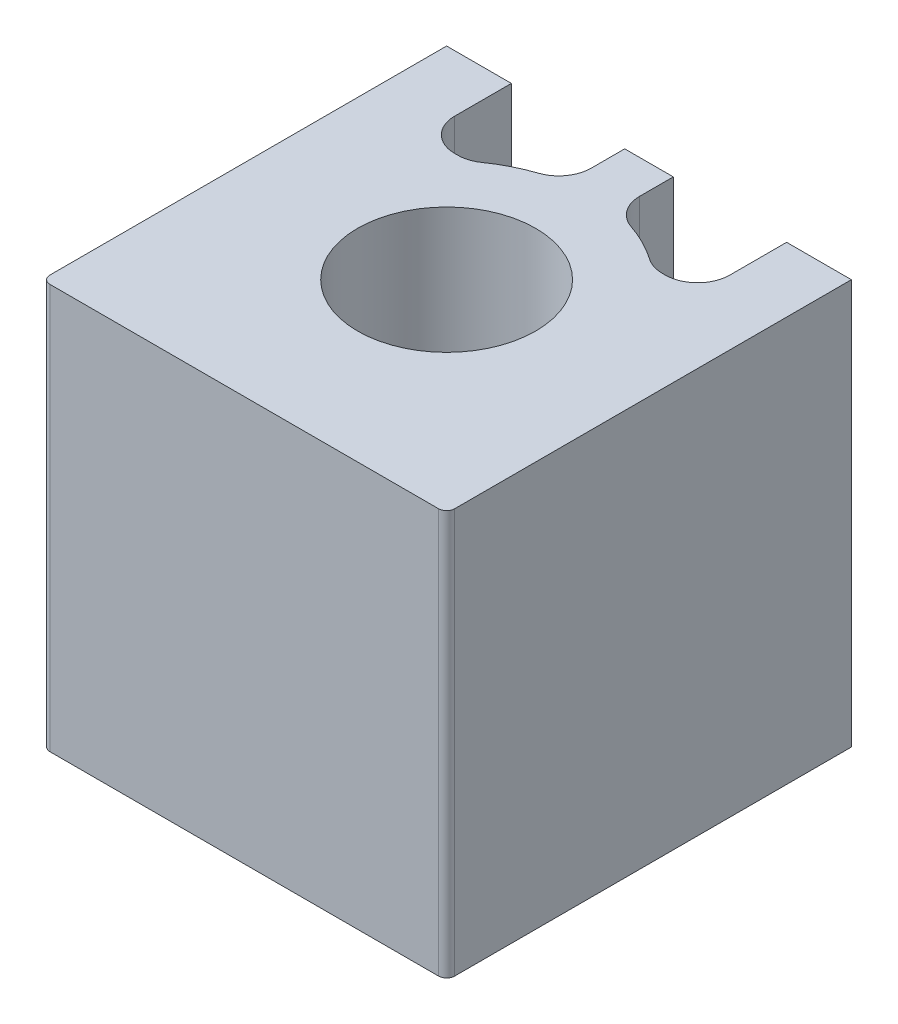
ISO-10303-21;
HEADER;
FILE_DESCRIPTION(('STEP AP214'),'2;1');
FILE_NAME('part.step','',(''),(''),'','','');
FILE_SCHEMA(('AUTOMOTIVE_DESIGN { 1 0 10303 214 1 1 1 1 }'));
ENDSEC;
DATA;
#1=APPLICATION_CONTEXT('core data for automotive mechanical design processes');
#2=APPLICATION_PROTOCOL_DEFINITION('international standard','automotive_design',2000,#1);
#3=PRODUCT_CONTEXT('',#1,'mechanical');
#4=PRODUCT('Part','Part','',(#3));
#5=PRODUCT_RELATED_PRODUCT_CATEGORY('part','',(#4));
#6=PRODUCT_DEFINITION_FORMATION('','',#4);
#7=PRODUCT_DEFINITION_CONTEXT('part definition',#1,'design');
#8=PRODUCT_DEFINITION('design','',#6,#7);
#9=PRODUCT_DEFINITION_SHAPE('','',#8);
#10=(LENGTH_UNIT() NAMED_UNIT(*) SI_UNIT(.MILLI.,.METRE.));
#11=(NAMED_UNIT(*) PLANE_ANGLE_UNIT() SI_UNIT($,.RADIAN.));
#12=(NAMED_UNIT(*) SI_UNIT($,.STERADIAN.) SOLID_ANGLE_UNIT());
#13=UNCERTAINTY_MEASURE_WITH_UNIT(LENGTH_MEASURE(1.E-05),#10,'distance_accuracy_value','');
#14=(GEOMETRIC_REPRESENTATION_CONTEXT(3) GLOBAL_UNCERTAINTY_ASSIGNED_CONTEXT((#13)) GLOBAL_UNIT_ASSIGNED_CONTEXT((#10,
#11,#12)) REPRESENTATION_CONTEXT('',''));
#15=CARTESIAN_POINT('',(0.,0.,0.));
#16=DIRECTION('',(0.,0.,1.));
#17=DIRECTION('',(1.,0.,0.));
#18=AXIS2_PLACEMENT_3D('',#15,#16,#17);
#19=CARTESIAN_POINT('',(0.,25.,-25.));
#20=DIRECTION('',(0.,0.,1.));
#21=DIRECTION('',(1.,0.,0.));
#22=AXIS2_PLACEMENT_3D('',#19,#20,#21);
#23=PLANE('',#22);
#24=DIRECTION('',(-1.,0.,0.));
#25=VECTOR('',#24,1.);
#26=CARTESIAN_POINT('',(0.,0.,-25.));
#27=LINE('',#26,#25);
#28=CARTESIAN_POINT('',(25.,0.,-25.));
#29=VERTEX_POINT('',#28);
#30=CARTESIAN_POINT('',(21.,0.,-25.));
#31=VERTEX_POINT('',#30);
#32=EDGE_CURVE('E210',#29,#31,#27,.T.);
#33=ORIENTED_EDGE('',*,*,#32,.T.);
#34=DIRECTION('',(0.,1.,0.));
#35=VECTOR('',#34,1.);
#36=CARTESIAN_POINT('',(21.,25.,-25.));
#37=LINE('',#36,#35);
#38=CARTESIAN_POINT('',(21.,25.,-25.));
#39=VERTEX_POINT('',#38);
#40=EDGE_CURVE('E203',#31,#39,#37,.T.);
#41=ORIENTED_EDGE('',*,*,#40,.T.);
#42=DIRECTION('',(-1.,0.,0.));
#43=VECTOR('',#42,1.);
#44=CARTESIAN_POINT('',(0.,25.,-25.));
#45=LINE('',#44,#43);
#46=CARTESIAN_POINT('',(25.,25.,-25.));
#47=VERTEX_POINT('',#46);
#48=EDGE_CURVE('E334',#47,#39,#45,.T.);
#49=ORIENTED_EDGE('',*,*,#48,.F.);
#50=DIRECTION('',(0.,-1.,0.));
#51=VECTOR('',#50,1.);
#52=CARTESIAN_POINT('',(25.,25.,-25.));
#53=LINE('',#52,#51);
#54=EDGE_CURVE('E243',#47,#29,#53,.T.);
#55=ORIENTED_EDGE('',*,*,#54,.T.);
#56=EDGE_LOOP('',(#33,#41,#49,#55));
#57=FACE_BOUND('',#56,.T.);
#58=ADVANCED_FACE('F34',(#57),#23,.F.);
#59=CARTESIAN_POINT('',(4.,25.,-25.));
#60=VERTEX_POINT('',#59);
#61=CARTESIAN_POINT('',(0.,25.,-25.));
#62=VERTEX_POINT('',#61);
#63=EDGE_CURVE('E333',#60,#62,#45,.T.);
#64=ORIENTED_EDGE('',*,*,#63,.F.);
#65=DIRECTION('',(0.,-1.,0.));
#66=VECTOR('',#65,1.);
#67=CARTESIAN_POINT('',(4.,25.,-25.));
#68=LINE('',#67,#66);
#69=CARTESIAN_POINT('',(4.,0.,-25.));
#70=VERTEX_POINT('',#69);
#71=EDGE_CURVE('E312',#60,#70,#68,.T.);
#72=ORIENTED_EDGE('',*,*,#71,.T.);
#73=CARTESIAN_POINT('',(0.,0.,-25.));
#74=VERTEX_POINT('',#73);
#75=EDGE_CURVE('E211',#70,#74,#27,.T.);
#76=ORIENTED_EDGE('',*,*,#75,.T.);
#77=DIRECTION('',(0.,-1.,0.));
#78=VECTOR('',#77,1.);
#79=CARTESIAN_POINT('',(0.,25.,-25.));
#80=LINE('',#79,#78);
#81=EDGE_CURVE('E240',#62,#74,#80,.T.);
#82=ORIENTED_EDGE('',*,*,#81,.F.);
#83=EDGE_LOOP('',(#64,#72,#76,#82));
#84=FACE_BOUND('',#83,.T.);
#85=ADVANCED_FACE('F407',(#84),#23,.F.);
#86=CARTESIAN_POINT('',(25.,25.,-25.));
#87=DIRECTION('',(-1.,0.,0.));
#88=DIRECTION('',(0.,0.,1.));
#89=AXIS2_PLACEMENT_3D('',#86,#87,#88);
#90=PLANE('',#89);
#91=DIRECTION('',(0.,0.,-1.));
#92=VECTOR('',#91,1.);
#93=CARTESIAN_POINT('',(25.,0.,-25.));
#94=LINE('',#93,#92);
#95=CARTESIAN_POINT('',(25.,0.,-0.500000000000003));
#96=VERTEX_POINT('',#95);
#97=EDGE_CURVE('E215',#96,#29,#94,.T.);
#98=ORIENTED_EDGE('',*,*,#97,.T.);
#99=ORIENTED_EDGE('',*,*,#54,.F.);
#100=DIRECTION('',(0.,0.,-1.));
#101=VECTOR('',#100,1.);
#102=CARTESIAN_POINT('',(25.,25.,-25.));
#103=LINE('',#102,#101);
#104=CARTESIAN_POINT('',(25.,25.,-0.500000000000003));
#105=VERTEX_POINT('',#104);
#106=EDGE_CURVE('E226',#105,#47,#103,.T.);
#107=ORIENTED_EDGE('',*,*,#106,.F.);
#108=DIRECTION('',(0.,-1.,0.));
#109=VECTOR('',#108,1.);
#110=CARTESIAN_POINT('',(25.,25.,-0.500000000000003));
#111=LINE('',#110,#109);
#112=EDGE_CURVE('E227',#105,#96,#111,.T.);
#113=ORIENTED_EDGE('',*,*,#112,.T.);
#114=EDGE_LOOP('',(#98,#99,#107,#113));
#115=FACE_BOUND('',#114,.T.);
#116=ADVANCED_FACE('F356',(#115),#90,.F.);
#117=CARTESIAN_POINT('',(14.,25.,-25.));
#118=VERTEX_POINT('',#117);
#119=CARTESIAN_POINT('',(11.,25.,-25.));
#120=VERTEX_POINT('',#119);
#121=EDGE_CURVE('E202',#118,#120,#45,.T.);
#122=ORIENTED_EDGE('',*,*,#121,.F.);
#123=DIRECTION('',(0.,-1.,0.));
#124=VECTOR('',#123,1.);
#125=CARTESIAN_POINT('',(14.,25.,-25.));
#126=LINE('',#125,#124);
#127=CARTESIAN_POINT('',(14.,0.,-25.));
#128=VERTEX_POINT('',#127);
#129=EDGE_CURVE('E187',#118,#128,#126,.T.);
#130=ORIENTED_EDGE('',*,*,#129,.T.);
#131=CARTESIAN_POINT('',(11.,0.,-25.));
#132=VERTEX_POINT('',#131);
#133=EDGE_CURVE('E200',#128,#132,#27,.T.);
#134=ORIENTED_EDGE('',*,*,#133,.T.);
#135=DIRECTION('',(0.,1.,0.));
#136=VECTOR('',#135,1.);
#137=CARTESIAN_POINT('',(11.,25.,-25.));
#138=LINE('',#137,#136);
#139=EDGE_CURVE('E325',#132,#120,#138,.T.);
#140=ORIENTED_EDGE('',*,*,#139,.T.);
#141=EDGE_LOOP('',(#122,#130,#134,#140));
#142=FACE_BOUND('',#141,.T.);
#143=ADVANCED_FACE('F198',(#142),#23,.F.);
#144=CARTESIAN_POINT('',(0.,25.,-25.));
#145=DIRECTION('',(1.,0.,0.));
#146=DIRECTION('',(0.,0.,-1.));
#147=AXIS2_PLACEMENT_3D('',#144,#145,#146);
#148=PLANE('',#147);
#149=DIRECTION('',(0.,0.,1.));
#150=VECTOR('',#149,1.);
#151=CARTESIAN_POINT('',(0.,0.,-25.));
#152=LINE('',#151,#150);
#153=CARTESIAN_POINT('',(0.,0.,-0.500000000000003));
#154=VERTEX_POINT('',#153);
#155=EDGE_CURVE('E214',#74,#154,#152,.T.);
#156=ORIENTED_EDGE('',*,*,#155,.T.);
#157=DIRECTION('',(0.,-1.,0.));
#158=VECTOR('',#157,1.);
#159=CARTESIAN_POINT('',(0.,25.,-0.500000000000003));
#160=LINE('',#159,#158);
#161=CARTESIAN_POINT('',(0.,25.,-0.500000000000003));
#162=VERTEX_POINT('',#161);
#163=EDGE_CURVE('E237',#162,#154,#160,.T.);
#164=ORIENTED_EDGE('',*,*,#163,.F.);
#165=DIRECTION('',(0.,0.,1.));
#166=VECTOR('',#165,1.);
#167=CARTESIAN_POINT('',(0.,25.,-25.));
#168=LINE('',#167,#166);
#169=EDGE_CURVE('E337',#62,#162,#168,.T.);
#170=ORIENTED_EDGE('',*,*,#169,.F.);
#171=ORIENTED_EDGE('',*,*,#81,.T.);
#172=EDGE_LOOP('',(#156,#164,#170,#171));
#173=FACE_BOUND('',#172,.T.);
#174=ADVANCED_FACE('F416',(#173),#148,.F.);
#175=CARTESIAN_POINT('',(0.5,25.,-0.5));
#176=DIRECTION('',(0.,-1.,0.));
#177=DIRECTION('',(0.,0.,-1.));
#178=AXIS2_PLACEMENT_3D('',#175,#176,#177);
#179=CYLINDRICAL_SURFACE('',#178,0.5);
#180=CARTESIAN_POINT('',(0.5,0.,-0.5));
#181=DIRECTION('',(0.,1.,0.));
#182=DIRECTION('',(0.,0.,1.));
#183=AXIS2_PLACEMENT_3D('',#180,#181,#182);
#184=CIRCLE('',#183,0.5);
#185=CARTESIAN_POINT('',(0.500000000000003,0.,0.));
#186=VERTEX_POINT('',#185);
#187=EDGE_CURVE('E220',#154,#186,#184,.T.);
#188=ORIENTED_EDGE('',*,*,#187,.T.);
#189=DIRECTION('',(0.,-1.,0.));
#190=VECTOR('',#189,1.);
#191=CARTESIAN_POINT('',(0.500000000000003,25.,0.));
#192=LINE('',#191,#190);
#193=CARTESIAN_POINT('',(0.500000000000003,25.,0.));
#194=VERTEX_POINT('',#193);
#195=EDGE_CURVE('E234',#194,#186,#192,.T.);
#196=ORIENTED_EDGE('',*,*,#195,.F.);
#197=CARTESIAN_POINT('',(0.5,25.,-0.5));
#198=DIRECTION('',(0.,1.,0.));
#199=DIRECTION('',(0.,0.,1.));
#200=AXIS2_PLACEMENT_3D('',#197,#198,#199);
#201=CIRCLE('',#200,0.5);
#202=EDGE_CURVE('E339',#162,#194,#201,.T.);
#203=ORIENTED_EDGE('',*,*,#202,.F.);
#204=ORIENTED_EDGE('',*,*,#163,.T.);
#205=EDGE_LOOP('',(#188,#196,#203,#204));
#206=FACE_BOUND('',#205,.T.);
#207=ADVANCED_FACE('F421',(#206),#179,.T.);
#208=CARTESIAN_POINT('',(0.500000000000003,25.,0.));
#209=DIRECTION('',(0.,0.,-1.));
#210=DIRECTION('',(-1.,0.,0.));
#211=AXIS2_PLACEMENT_3D('',#208,#209,#210);
#212=PLANE('',#211);
#213=DIRECTION('',(1.,0.,0.));
#214=VECTOR('',#213,1.);
#215=CARTESIAN_POINT('',(0.500000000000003,0.,0.));
#216=LINE('',#215,#214);
#217=CARTESIAN_POINT('',(24.5,0.,0.));
#218=VERTEX_POINT('',#217);
#219=EDGE_CURVE('E222',#186,#218,#216,.T.);
#220=ORIENTED_EDGE('',*,*,#219,.T.);
#221=DIRECTION('',(0.,-1.,0.));
#222=VECTOR('',#221,1.);
#223=CARTESIAN_POINT('',(24.5,25.,0.));
#224=LINE('',#223,#222);
#225=CARTESIAN_POINT('',(24.5,25.,0.));
#226=VERTEX_POINT('',#225);
#227=EDGE_CURVE('E230',#226,#218,#224,.T.);
#228=ORIENTED_EDGE('',*,*,#227,.F.);
#229=DIRECTION('',(1.,0.,0.));
#230=VECTOR('',#229,1.);
#231=CARTESIAN_POINT('',(0.500000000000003,25.,0.));
#232=LINE('',#231,#230);
#233=EDGE_CURVE('E341',#194,#226,#232,.T.);
#234=ORIENTED_EDGE('',*,*,#233,.F.);
#235=ORIENTED_EDGE('',*,*,#195,.T.);
#236=EDGE_LOOP('',(#220,#228,#234,#235));
#237=FACE_BOUND('',#236,.T.);
#238=ADVANCED_FACE('F466',(#237),#212,.F.);
#239=CARTESIAN_POINT('',(24.5,25.,-0.5));
#240=DIRECTION('',(0.,-1.,0.));
#241=DIRECTION('',(0.,0.,-1.));
#242=AXIS2_PLACEMENT_3D('',#239,#240,#241);
#243=CYLINDRICAL_SURFACE('',#242,0.5);
#244=CARTESIAN_POINT('',(24.5,0.,-0.5));
#245=DIRECTION('',(0.,1.,0.));
#246=DIRECTION('',(0.,0.,1.));
#247=AXIS2_PLACEMENT_3D('',#244,#245,#246);
#248=CIRCLE('',#247,0.5);
#249=EDGE_CURVE('E224',#218,#96,#248,.T.);
#250=ORIENTED_EDGE('',*,*,#249,.T.);
#251=ORIENTED_EDGE('',*,*,#112,.F.);
#252=CARTESIAN_POINT('',(24.5,25.,-0.5));
#253=DIRECTION('',(0.,1.,0.));
#254=DIRECTION('',(0.,0.,1.));
#255=AXIS2_PLACEMENT_3D('',#252,#253,#254);
#256=CIRCLE('',#255,0.5);
#257=EDGE_CURVE('E231',#226,#105,#256,.T.);
#258=ORIENTED_EDGE('',*,*,#257,.F.);
#259=ORIENTED_EDGE('',*,*,#227,.T.);
#260=EDGE_LOOP('',(#250,#251,#258,#259));
#261=FACE_BOUND('',#260,.T.);
#262=ADVANCED_FACE('F351',(#261),#243,.T.);
#263=CARTESIAN_POINT('',(24.5,25.,-0.5));
#264=DIRECTION('',(0.,1.,0.));
#265=DIRECTION('',(0.,0.,1.));
#266=AXIS2_PLACEMENT_3D('',#263,#264,#265);
#267=PLANE('',#266);
#268=CARTESIAN_POINT('',(12.5,25.,-12.5));
#269=DIRECTION('',(0.,-1.,0.));
#270=DIRECTION('',(0.,0.,-1.));
#271=AXIS2_PLACEMENT_3D('',#268,#269,#270);
#272=CIRCLE('',#271,5.5);
#273=CARTESIAN_POINT('',(12.5,25.,-18.));
#274=VERTEX_POINT('',#273);
#275=EDGE_CURVE('E377',#274,#274,#272,.T.);
#276=ORIENTED_EDGE('',*,*,#275,.T.);
#277=EDGE_LOOP('',(#276));
#278=FACE_BOUND('',#277,.T.);
#279=DIRECTION('',(0.,0.,1.));
#280=VECTOR('',#279,1.);
#281=CARTESIAN_POINT('',(21.,25.,-30.5));
#282=LINE('',#281,#280);
#283=CARTESIAN_POINT('',(21.,25.,-21.5));
#284=VERTEX_POINT('',#283);
#285=EDGE_CURVE('E193',#39,#284,#282,.T.);
#286=ORIENTED_EDGE('',*,*,#285,.T.);
#287=CARTESIAN_POINT('',(19.,25.,-21.5));
#288=DIRECTION('',(0.,1.,0.));
#289=DIRECTION('',(0.,0.,1.));
#290=AXIS2_PLACEMENT_3D('',#287,#288,#289);
#291=CIRCLE('',#290,2.);
#292=CARTESIAN_POINT('',(19.,25.,-19.5));
#293=VERTEX_POINT('',#292);
#294=EDGE_CURVE('E282',#284,#293,#291,.F.);
#295=ORIENTED_EDGE('',*,*,#294,.T.);
#296=DIRECTION('',(-1.,0.,0.));
#297=VECTOR('',#296,1.);
#298=CARTESIAN_POINT('',(21.,25.,-19.5));
#299=LINE('',#298,#297);
#300=CARTESIAN_POINT('',(18.8245553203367,25.,-19.5));
#301=VERTEX_POINT('',#300);
#302=EDGE_CURVE('E364',#293,#301,#299,.T.);
#303=ORIENTED_EDGE('',*,*,#302,.T.);
#304=CARTESIAN_POINT('',(18.8245553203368,25.,-21.5));
#305=DIRECTION('',(0.,1.,0.));
#306=DIRECTION('',(0.,0.,1.));
#307=AXIS2_PLACEMENT_3D('',#304,#305,#306);
#308=CIRCLE('',#307,2.);
#309=CARTESIAN_POINT('',(17.6746361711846,25.,-19.8636363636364));
#310=VERTEX_POINT('',#309);
#311=EDGE_CURVE('E286',#301,#310,#308,.F.);
#312=ORIENTED_EDGE('',*,*,#311,.T.);
#313=CARTESIAN_POINT('',(12.5,25.,-12.5));
#314=DIRECTION('',(0.,1.,0.));
#315=DIRECTION('',(0.,0.,-1.));
#316=AXIS2_PLACEMENT_3D('',#313,#314,#315);
#317=CIRCLE('',#316,9.);
#318=CARTESIAN_POINT('',(15.3636363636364,25.,-21.0322673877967));
#319=VERTEX_POINT('',#318);
#320=EDGE_CURVE('E386',#310,#319,#317,.T.);
#321=ORIENTED_EDGE('',*,*,#320,.T.);
#322=CARTESIAN_POINT('',(16.,25.,-22.9283268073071));
#323=DIRECTION('',(0.,1.,0.));
#324=DIRECTION('',(0.,0.,1.));
#325=AXIS2_PLACEMENT_3D('',#322,#323,#324);
#326=CIRCLE('',#325,2.);
#327=CARTESIAN_POINT('',(14.,25.,-22.9283268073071));
#328=VERTEX_POINT('',#327);
#329=EDGE_CURVE('E290',#319,#328,#326,.F.);
#330=ORIENTED_EDGE('',*,*,#329,.T.);
#331=DIRECTION('',(0.,0.,-1.));
#332=VECTOR('',#331,1.);
#333=CARTESIAN_POINT('',(14.,25.,-21.3741196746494));
#334=LINE('',#333,#332);
#335=EDGE_CURVE('E204',#328,#118,#334,.T.);
#336=ORIENTED_EDGE('',*,*,#335,.T.);
#337=ORIENTED_EDGE('',*,*,#121,.T.);
#338=DIRECTION('',(0.,0.,1.));
#339=VECTOR('',#338,1.);
#340=CARTESIAN_POINT('',(11.,25.,-21.3741196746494));
#341=LINE('',#340,#339);
#342=CARTESIAN_POINT('',(11.,25.,-22.9283268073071));
#343=VERTEX_POINT('',#342);
#344=EDGE_CURVE('E314',#120,#343,#341,.T.);
#345=ORIENTED_EDGE('',*,*,#344,.T.);
#346=CARTESIAN_POINT('',(9.,25.,-22.9283268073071));
#347=DIRECTION('',(0.,1.,0.));
#348=DIRECTION('',(0.,0.,1.));
#349=AXIS2_PLACEMENT_3D('',#346,#347,#348);
#350=CIRCLE('',#349,2.);
#351=CARTESIAN_POINT('',(9.63636363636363,25.,-21.0322673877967));
#352=VERTEX_POINT('',#351);
#353=EDGE_CURVE('E278',#343,#352,#350,.F.);
#354=ORIENTED_EDGE('',*,*,#353,.T.);
#355=CARTESIAN_POINT('',(12.5,25.,-12.5));
#356=DIRECTION('',(0.,1.,0.));
#357=DIRECTION('',(0.,0.,-1.));
#358=AXIS2_PLACEMENT_3D('',#355,#356,#357);
#359=CIRCLE('',#358,9.);
#360=CARTESIAN_POINT('',(7.32536382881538,25.,-19.8636363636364));
#361=VERTEX_POINT('',#360);
#362=EDGE_CURVE('E317',#352,#361,#359,.T.);
#363=ORIENTED_EDGE('',*,*,#362,.T.);
#364=CARTESIAN_POINT('',(6.17544467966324,25.,-21.5));
#365=DIRECTION('',(0.,1.,0.));
#366=DIRECTION('',(0.,0.,1.));
#367=AXIS2_PLACEMENT_3D('',#364,#365,#366);
#368=CIRCLE('',#367,2.);
#369=CARTESIAN_POINT('',(6.17544467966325,25.,-19.5));
#370=VERTEX_POINT('',#369);
#371=EDGE_CURVE('E294',#361,#370,#368,.F.);
#372=ORIENTED_EDGE('',*,*,#371,.T.);
#373=DIRECTION('',(-1.,0.,0.));
#374=VECTOR('',#373,1.);
#375=CARTESIAN_POINT('',(4.,25.,-19.5));
#376=LINE('',#375,#374);
#377=CARTESIAN_POINT('',(6.,25.,-19.5));
#378=VERTEX_POINT('',#377);
#379=EDGE_CURVE('E323',#370,#378,#376,.T.);
#380=ORIENTED_EDGE('',*,*,#379,.T.);
#381=CARTESIAN_POINT('',(6.,25.,-21.5));
#382=DIRECTION('',(0.,1.,0.));
#383=DIRECTION('',(0.,0.,1.));
#384=AXIS2_PLACEMENT_3D('',#381,#382,#383);
#385=CIRCLE('',#384,2.);
#386=CARTESIAN_POINT('',(4.,25.,-21.5));
#387=VERTEX_POINT('',#386);
#388=EDGE_CURVE('E11',#378,#387,#385,.F.);
#389=ORIENTED_EDGE('',*,*,#388,.T.);
#390=DIRECTION('',(0.,0.,-1.));
#391=VECTOR('',#390,1.);
#392=CARTESIAN_POINT('',(4.,25.,-30.5));
#393=LINE('',#392,#391);
#394=EDGE_CURVE('E305',#387,#60,#393,.T.);
#395=ORIENTED_EDGE('',*,*,#394,.T.);
#396=ORIENTED_EDGE('',*,*,#63,.T.);
#397=ORIENTED_EDGE('',*,*,#169,.T.);
#398=ORIENTED_EDGE('',*,*,#202,.T.);
#399=ORIENTED_EDGE('',*,*,#233,.T.);
#400=ORIENTED_EDGE('',*,*,#257,.T.);
#401=ORIENTED_EDGE('',*,*,#106,.T.);
#402=ORIENTED_EDGE('',*,*,#48,.T.);
#403=EDGE_LOOP('',(#286,#295,#303,#312,#321,#330,#336,#337,#345,#354,#363,#372,#380,#389,#395,
#396,#397,#398,#399,#400,#401,#402));
#404=FACE_BOUND('',#403,.T.);
#405=ADVANCED_FACE('F345',(#278,#404),#267,.T.);
#406=CARTESIAN_POINT('',(24.5,0.,-0.5));
#407=DIRECTION('',(0.,1.,0.));
#408=DIRECTION('',(0.,0.,1.));
#409=AXIS2_PLACEMENT_3D('',#406,#407,#408);
#410=PLANE('',#409);
#411=CARTESIAN_POINT('',(12.5,0.,-12.5));
#412=DIRECTION('',(0.,-1.,0.));
#413=DIRECTION('',(0.,0.,-1.));
#414=AXIS2_PLACEMENT_3D('',#411,#412,#413);
#415=CIRCLE('',#414,5.5);
#416=CARTESIAN_POINT('',(12.5,0.,-18.));
#417=VERTEX_POINT('',#416);
#418=EDGE_CURVE('E382',#417,#417,#415,.T.);
#419=ORIENTED_EDGE('',*,*,#418,.F.);
#420=EDGE_LOOP('',(#419));
#421=FACE_BOUND('',#420,.T.);
#422=DIRECTION('',(-1.,0.,0.));
#423=VECTOR('',#422,1.);
#424=CARTESIAN_POINT('',(21.,0.,-19.5));
#425=LINE('',#424,#423);
#426=CARTESIAN_POINT('',(19.,0.,-19.5));
#427=VERTEX_POINT('',#426);
#428=CARTESIAN_POINT('',(18.8245553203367,0.,-19.5));
#429=VERTEX_POINT('',#428);
#430=EDGE_CURVE('E373',#427,#429,#425,.T.);
#431=ORIENTED_EDGE('',*,*,#430,.F.);
#432=CARTESIAN_POINT('',(19.,0.,-21.5));
#433=DIRECTION('',(0.,1.,0.));
#434=DIRECTION('',(0.,0.,1.));
#435=AXIS2_PLACEMENT_3D('',#432,#433,#434);
#436=CIRCLE('',#435,2.);
#437=CARTESIAN_POINT('',(21.,0.,-21.5));
#438=VERTEX_POINT('',#437);
#439=EDGE_CURVE('E280',#427,#438,#436,.T.);
#440=ORIENTED_EDGE('',*,*,#439,.T.);
#441=DIRECTION('',(0.,0.,-1.));
#442=VECTOR('',#441,1.);
#443=CARTESIAN_POINT('',(21.,0.,-0.5));
#444=LINE('',#443,#442);
#445=EDGE_CURVE('E247',#438,#31,#444,.T.);
#446=ORIENTED_EDGE('',*,*,#445,.T.);
#447=ORIENTED_EDGE('',*,*,#32,.F.);
#448=ORIENTED_EDGE('',*,*,#97,.F.);
#449=ORIENTED_EDGE('',*,*,#249,.F.);
#450=ORIENTED_EDGE('',*,*,#219,.F.);
#451=ORIENTED_EDGE('',*,*,#187,.F.);
#452=ORIENTED_EDGE('',*,*,#155,.F.);
#453=ORIENTED_EDGE('',*,*,#75,.F.);
#454=DIRECTION('',(0.,0.,-1.));
#455=VECTOR('',#454,1.);
#456=CARTESIAN_POINT('',(4.,0.,-30.5));
#457=LINE('',#456,#455);
#458=CARTESIAN_POINT('',(4.,0.,-21.5));
#459=VERTEX_POINT('',#458);
#460=EDGE_CURVE('E300',#459,#70,#457,.T.);
#461=ORIENTED_EDGE('',*,*,#460,.F.);
#462=CARTESIAN_POINT('',(6.,0.,-21.5));
#463=DIRECTION('',(0.,1.,0.));
#464=DIRECTION('',(0.,0.,1.));
#465=AXIS2_PLACEMENT_3D('',#462,#463,#464);
#466=CIRCLE('',#465,2.);
#467=CARTESIAN_POINT('',(6.,0.,-19.5));
#468=VERTEX_POINT('',#467);
#469=EDGE_CURVE('E42',#459,#468,#466,.T.);
#470=ORIENTED_EDGE('',*,*,#469,.T.);
#471=DIRECTION('',(-1.,0.,0.));
#472=VECTOR('',#471,1.);
#473=CARTESIAN_POINT('',(4.,0.,-19.5));
#474=LINE('',#473,#472);
#475=CARTESIAN_POINT('',(6.17544467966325,0.,-19.5));
#476=VERTEX_POINT('',#475);
#477=EDGE_CURVE('E298',#476,#468,#474,.T.);
#478=ORIENTED_EDGE('',*,*,#477,.F.);
#479=CARTESIAN_POINT('',(6.17544467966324,0.,-21.5));
#480=DIRECTION('',(0.,1.,0.));
#481=DIRECTION('',(0.,0.,1.));
#482=AXIS2_PLACEMENT_3D('',#479,#480,#481);
#483=CIRCLE('',#482,2.);
#484=CARTESIAN_POINT('',(7.32536382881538,0.,-19.8636363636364));
#485=VERTEX_POINT('',#484);
#486=EDGE_CURVE('E292',#476,#485,#483,.T.);
#487=ORIENTED_EDGE('',*,*,#486,.T.);
#488=CARTESIAN_POINT('',(12.5,0.,-12.5));
#489=DIRECTION('',(0.,1.,0.));
#490=DIRECTION('',(0.,0.,-1.));
#491=AXIS2_PLACEMENT_3D('',#488,#489,#490);
#492=CIRCLE('',#491,9.);
#493=CARTESIAN_POINT('',(9.63636363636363,0.,-21.0322673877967));
#494=VERTEX_POINT('',#493);
#495=EDGE_CURVE('E306',#494,#485,#492,.T.);
#496=ORIENTED_EDGE('',*,*,#495,.F.);
#497=CARTESIAN_POINT('',(9.,0.,-22.9283268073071));
#498=DIRECTION('',(0.,1.,0.));
#499=DIRECTION('',(0.,0.,1.));
#500=AXIS2_PLACEMENT_3D('',#497,#498,#499);
#501=CIRCLE('',#500,2.);
#502=CARTESIAN_POINT('',(11.,0.,-22.9283268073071));
#503=VERTEX_POINT('',#502);
#504=EDGE_CURVE('E276',#494,#503,#501,.T.);
#505=ORIENTED_EDGE('',*,*,#504,.T.);
#506=DIRECTION('',(0.,0.,-1.));
#507=VECTOR('',#506,1.);
#508=CARTESIAN_POINT('',(11.,0.,-0.499999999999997));
#509=LINE('',#508,#507);
#510=EDGE_CURVE('E209',#503,#132,#509,.T.);
#511=ORIENTED_EDGE('',*,*,#510,.T.);
#512=ORIENTED_EDGE('',*,*,#133,.F.);
#513=DIRECTION('',(0.,0.,-1.));
#514=VECTOR('',#513,1.);
#515=CARTESIAN_POINT('',(14.,0.,-21.3741196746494));
#516=LINE('',#515,#514);
#517=CARTESIAN_POINT('',(14.,0.,-22.9283268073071));
#518=VERTEX_POINT('',#517);
#519=EDGE_CURVE('E183',#518,#128,#516,.T.);
#520=ORIENTED_EDGE('',*,*,#519,.F.);
#521=CARTESIAN_POINT('',(16.,0.,-22.9283268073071));
#522=DIRECTION('',(0.,1.,0.));
#523=DIRECTION('',(0.,0.,1.));
#524=AXIS2_PLACEMENT_3D('',#521,#522,#523);
#525=CIRCLE('',#524,2.);
#526=CARTESIAN_POINT('',(15.3636363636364,0.,-21.0322673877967));
#527=VERTEX_POINT('',#526);
#528=EDGE_CURVE('E288',#518,#527,#525,.T.);
#529=ORIENTED_EDGE('',*,*,#528,.T.);
#530=CARTESIAN_POINT('',(12.5,0.,-12.5));
#531=DIRECTION('',(0.,1.,0.));
#532=DIRECTION('',(0.,0.,-1.));
#533=AXIS2_PLACEMENT_3D('',#530,#531,#532);
#534=CIRCLE('',#533,9.);
#535=CARTESIAN_POINT('',(17.6746361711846,0.,-19.8636363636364));
#536=VERTEX_POINT('',#535);
#537=EDGE_CURVE('E194',#536,#527,#534,.T.);
#538=ORIENTED_EDGE('',*,*,#537,.F.);
#539=CARTESIAN_POINT('',(18.8245553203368,0.,-21.5));
#540=DIRECTION('',(0.,1.,0.));
#541=DIRECTION('',(0.,0.,1.));
#542=AXIS2_PLACEMENT_3D('',#539,#540,#541);
#543=CIRCLE('',#542,2.);
#544=EDGE_CURVE('E284',#536,#429,#543,.T.);
#545=ORIENTED_EDGE('',*,*,#544,.T.);
#546=EDGE_LOOP('',(#431,#440,#446,#447,#448,#449,#450,#451,#452,#453,#461,#470,#478,#487,#496,
#505,#511,#512,#520,#529,#538,#545));
#547=FACE_BOUND('',#546,.T.);
#548=ADVANCED_FACE('F207',(#421,#547),#410,.F.);
#549=CARTESIAN_POINT('',(4.,25.,-30.5));
#550=DIRECTION('',(-1.,0.,0.));
#551=DIRECTION('',(0.,0.,1.));
#552=AXIS2_PLACEMENT_3D('',#549,#550,#551);
#553=PLANE('',#552);
#554=ORIENTED_EDGE('',*,*,#394,.F.);
#555=DIRECTION('',(0.,-1.,0.));
#556=VECTOR('',#555,1.);
#557=CARTESIAN_POINT('',(4.,0.,-21.5));
#558=LINE('',#557,#556);
#559=EDGE_CURVE('E274',#387,#459,#558,.T.);
#560=ORIENTED_EDGE('',*,*,#559,.T.);
#561=ORIENTED_EDGE('',*,*,#460,.T.);
#562=ORIENTED_EDGE('',*,*,#71,.F.);
#563=EDGE_LOOP('',(#554,#560,#561,#562));
#564=FACE_BOUND('',#563,.T.);
#565=ADVANCED_FACE('F309',(#564),#553,.F.);
#566=CARTESIAN_POINT('',(11.,25.,-21.3741196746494));
#567=DIRECTION('',(1.,0.,0.));
#568=DIRECTION('',(0.,0.,-1.));
#569=AXIS2_PLACEMENT_3D('',#566,#567,#568);
#570=PLANE('',#569);
#571=ORIENTED_EDGE('',*,*,#510,.F.);
#572=DIRECTION('',(0.,1.,0.));
#573=VECTOR('',#572,1.);
#574=CARTESIAN_POINT('',(11.,25.,-22.9283268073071));
#575=LINE('',#574,#573);
#576=EDGE_CURVE('E254',#503,#343,#575,.T.);
#577=ORIENTED_EDGE('',*,*,#576,.T.);
#578=ORIENTED_EDGE('',*,*,#344,.F.);
#579=ORIENTED_EDGE('',*,*,#139,.F.);
#580=EDGE_LOOP('',(#571,#577,#578,#579));
#581=FACE_BOUND('',#580,.T.);
#582=ADVANCED_FACE('F401',(#581),#570,.F.);
#583=CARTESIAN_POINT('',(4.,25.,-19.5));
#584=DIRECTION('',(0.,0.,1.));
#585=DIRECTION('',(1.,0.,0.));
#586=AXIS2_PLACEMENT_3D('',#583,#584,#585);
#587=PLANE('',#586);
#588=ORIENTED_EDGE('',*,*,#379,.F.);
#589=DIRECTION('',(0.,1.,0.));
#590=VECTOR('',#589,1.);
#591=CARTESIAN_POINT('',(6.17544467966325,0.,-19.5));
#592=LINE('',#591,#590);
#593=EDGE_CURVE('E271',#370,#476,#592,.F.);
#594=ORIENTED_EDGE('',*,*,#593,.T.);
#595=ORIENTED_EDGE('',*,*,#477,.T.);
#596=DIRECTION('',(0.,-1.,0.));
#597=VECTOR('',#596,1.);
#598=CARTESIAN_POINT('',(6.,25.,-19.5));
#599=LINE('',#598,#597);
#600=EDGE_CURVE('E269',#468,#378,#599,.F.);
#601=ORIENTED_EDGE('',*,*,#600,.T.);
#602=EDGE_LOOP('',(#588,#594,#595,#601));
#603=FACE_BOUND('',#602,.T.);
#604=ADVANCED_FACE('F303',(#603),#587,.F.);
#605=CARTESIAN_POINT('',(12.5,25.,-12.5));
#606=DIRECTION('',(0.,-1.,0.));
#607=DIRECTION('',(0.,0.,-1.));
#608=AXIS2_PLACEMENT_3D('',#605,#606,#607);
#609=CYLINDRICAL_SURFACE('',#608,9.);
#610=ORIENTED_EDGE('',*,*,#362,.F.);
#611=DIRECTION('',(0.,-1.,0.));
#612=VECTOR('',#611,1.);
#613=CARTESIAN_POINT('',(9.63636363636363,25.,-21.0322673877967));
#614=LINE('',#613,#612);
#615=EDGE_CURVE('E251',#352,#494,#614,.T.);
#616=ORIENTED_EDGE('',*,*,#615,.T.);
#617=ORIENTED_EDGE('',*,*,#495,.T.);
#618=DIRECTION('',(0.,-1.,0.));
#619=VECTOR('',#618,1.);
#620=CARTESIAN_POINT('',(7.32536382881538,25.,-19.8636363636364));
#621=LINE('',#620,#619);
#622=EDGE_CURVE('E249',#485,#361,#621,.F.);
#623=ORIENTED_EDGE('',*,*,#622,.T.);
#624=EDGE_LOOP('',(#610,#616,#617,#623));
#625=FACE_BOUND('',#624,.T.);
#626=ADVANCED_FACE('F451',(#625),#609,.T.);
#627=CARTESIAN_POINT('',(21.,25.,-30.5));
#628=DIRECTION('',(1.,0.,0.));
#629=DIRECTION('',(0.,0.,-1.));
#630=AXIS2_PLACEMENT_3D('',#627,#628,#629);
#631=PLANE('',#630);
#632=ORIENTED_EDGE('',*,*,#445,.F.);
#633=DIRECTION('',(0.,-1.,0.));
#634=VECTOR('',#633,1.);
#635=CARTESIAN_POINT('',(21.,25.,-21.5));
#636=LINE('',#635,#634);
#637=EDGE_CURVE('E261',#438,#284,#636,.F.);
#638=ORIENTED_EDGE('',*,*,#637,.T.);
#639=ORIENTED_EDGE('',*,*,#285,.F.);
#640=ORIENTED_EDGE('',*,*,#40,.F.);
#641=EDGE_LOOP('',(#632,#638,#639,#640));
#642=FACE_BOUND('',#641,.T.);
#643=ADVANCED_FACE('F467',(#642),#631,.F.);
#644=CARTESIAN_POINT('',(14.,25.,-21.3741196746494));
#645=DIRECTION('',(-1.,0.,0.));
#646=DIRECTION('',(0.,0.,1.));
#647=AXIS2_PLACEMENT_3D('',#644,#645,#646);
#648=PLANE('',#647);
#649=ORIENTED_EDGE('',*,*,#335,.F.);
#650=DIRECTION('',(0.,1.,0.));
#651=VECTOR('',#650,1.);
#652=CARTESIAN_POINT('',(14.,0.,-22.9283268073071));
#653=LINE('',#652,#651);
#654=EDGE_CURVE('E190',#328,#518,#653,.F.);
#655=ORIENTED_EDGE('',*,*,#654,.T.);
#656=ORIENTED_EDGE('',*,*,#519,.T.);
#657=ORIENTED_EDGE('',*,*,#129,.F.);
#658=EDGE_LOOP('',(#649,#655,#656,#657));
#659=FACE_BOUND('',#658,.T.);
#660=ADVANCED_FACE('F186',(#659),#648,.F.);
#661=CARTESIAN_POINT('',(12.5,25.,-12.5));
#662=DIRECTION('',(0.,-1.,0.));
#663=DIRECTION('',(0.,0.,-1.));
#664=AXIS2_PLACEMENT_3D('',#661,#662,#663);
#665=CYLINDRICAL_SURFACE('',#664,9.);
#666=ORIENTED_EDGE('',*,*,#320,.F.);
#667=DIRECTION('',(0.,-1.,0.));
#668=VECTOR('',#667,1.);
#669=CARTESIAN_POINT('',(17.6746361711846,25.,-19.8636363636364));
#670=LINE('',#669,#668);
#671=EDGE_CURVE('E265',#310,#536,#670,.T.);
#672=ORIENTED_EDGE('',*,*,#671,.T.);
#673=ORIENTED_EDGE('',*,*,#537,.T.);
#674=DIRECTION('',(0.,-1.,0.));
#675=VECTOR('',#674,1.);
#676=CARTESIAN_POINT('',(15.3636363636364,25.,-21.0322673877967));
#677=LINE('',#676,#675);
#678=EDGE_CURVE('E263',#527,#319,#677,.F.);
#679=ORIENTED_EDGE('',*,*,#678,.T.);
#680=EDGE_LOOP('',(#666,#672,#673,#679));
#681=FACE_BOUND('',#680,.T.);
#682=ADVANCED_FACE('F474',(#681),#665,.T.);
#683=CARTESIAN_POINT('',(21.,25.,-19.5));
#684=DIRECTION('',(0.,0.,1.));
#685=DIRECTION('',(1.,0.,0.));
#686=AXIS2_PLACEMENT_3D('',#683,#684,#685);
#687=PLANE('',#686);
#688=ORIENTED_EDGE('',*,*,#302,.F.);
#689=DIRECTION('',(0.,-1.,0.));
#690=VECTOR('',#689,1.);
#691=CARTESIAN_POINT('',(19.,0.,-19.5));
#692=LINE('',#691,#690);
#693=EDGE_CURVE('E258',#293,#427,#692,.T.);
#694=ORIENTED_EDGE('',*,*,#693,.T.);
#695=ORIENTED_EDGE('',*,*,#430,.T.);
#696=DIRECTION('',(0.,1.,0.));
#697=VECTOR('',#696,1.);
#698=CARTESIAN_POINT('',(18.8245553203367,25.,-19.5));
#699=LINE('',#698,#697);
#700=EDGE_CURVE('E256',#429,#301,#699,.T.);
#701=ORIENTED_EDGE('',*,*,#700,.T.);
#702=EDGE_LOOP('',(#688,#694,#695,#701));
#703=FACE_BOUND('',#702,.T.);
#704=ADVANCED_FACE('F372',(#703),#687,.F.);
#705=CARTESIAN_POINT('',(12.5,25.,-12.5));
#706=DIRECTION('',(0.,-1.,0.));
#707=DIRECTION('',(0.,0.,-1.));
#708=AXIS2_PLACEMENT_3D('',#705,#706,#707);
#709=CYLINDRICAL_SURFACE('',#708,5.5);
#710=ORIENTED_EDGE('',*,*,#275,.F.);
#711=EDGE_LOOP('',(#710));
#712=FACE_BOUND('',#711,.T.);
#713=ORIENTED_EDGE('',*,*,#418,.T.);
#714=EDGE_LOOP('',(#713));
#715=FACE_BOUND('',#714,.T.);
#716=ADVANCED_FACE('F393',(#712,#715),#709,.F.);
#717=CARTESIAN_POINT('',(9.,25.,-22.9283268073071));
#718=DIRECTION('',(0.,-1.,0.));
#719=DIRECTION('',(0.,0.,-1.));
#720=AXIS2_PLACEMENT_3D('',#717,#718,#719);
#721=CYLINDRICAL_SURFACE('',#720,2.);
#722=ORIENTED_EDGE('',*,*,#353,.F.);
#723=ORIENTED_EDGE('',*,*,#576,.F.);
#724=ORIENTED_EDGE('',*,*,#504,.F.);
#725=ORIENTED_EDGE('',*,*,#615,.F.);
#726=EDGE_LOOP('',(#722,#723,#724,#725));
#727=FACE_BOUND('',#726,.T.);
#728=ADVANCED_FACE('F426',(#727),#721,.F.);
#729=CARTESIAN_POINT('',(19.,25.,-21.5));
#730=DIRECTION('',(0.,1.,0.));
#731=DIRECTION('',(0.,0.,1.));
#732=AXIS2_PLACEMENT_3D('',#729,#730,#731);
#733=CYLINDRICAL_SURFACE('',#732,2.);
#734=ORIENTED_EDGE('',*,*,#294,.F.);
#735=ORIENTED_EDGE('',*,*,#637,.F.);
#736=ORIENTED_EDGE('',*,*,#439,.F.);
#737=ORIENTED_EDGE('',*,*,#693,.F.);
#738=EDGE_LOOP('',(#734,#735,#736,#737));
#739=FACE_BOUND('',#738,.T.);
#740=ADVANCED_FACE('F369',(#739),#733,.F.);
#741=CARTESIAN_POINT('',(18.8245553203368,25.,-21.5));
#742=DIRECTION('',(0.,-1.,0.));
#743=DIRECTION('',(0.,0.,-1.));
#744=AXIS2_PLACEMENT_3D('',#741,#742,#743);
#745=CYLINDRICAL_SURFACE('',#744,2.);
#746=ORIENTED_EDGE('',*,*,#311,.F.);
#747=ORIENTED_EDGE('',*,*,#700,.F.);
#748=ORIENTED_EDGE('',*,*,#544,.F.);
#749=ORIENTED_EDGE('',*,*,#671,.F.);
#750=EDGE_LOOP('',(#746,#747,#748,#749));
#751=FACE_BOUND('',#750,.T.);
#752=ADVANCED_FACE('F432',(#751),#745,.F.);
#753=CARTESIAN_POINT('',(16.,25.,-22.9283268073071));
#754=DIRECTION('',(0.,-1.,0.));
#755=DIRECTION('',(0.,0.,-1.));
#756=AXIS2_PLACEMENT_3D('',#753,#754,#755);
#757=CYLINDRICAL_SURFACE('',#756,2.);
#758=ORIENTED_EDGE('',*,*,#329,.F.);
#759=ORIENTED_EDGE('',*,*,#678,.F.);
#760=ORIENTED_EDGE('',*,*,#528,.F.);
#761=ORIENTED_EDGE('',*,*,#654,.F.);
#762=EDGE_LOOP('',(#758,#759,#760,#761));
#763=FACE_BOUND('',#762,.T.);
#764=ADVANCED_FACE('F435',(#763),#757,.F.);
#765=CARTESIAN_POINT('',(6.17544467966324,25.,-21.5));
#766=DIRECTION('',(0.,-1.,0.));
#767=DIRECTION('',(0.,0.,-1.));
#768=AXIS2_PLACEMENT_3D('',#765,#766,#767);
#769=CYLINDRICAL_SURFACE('',#768,2.);
#770=ORIENTED_EDGE('',*,*,#371,.F.);
#771=ORIENTED_EDGE('',*,*,#622,.F.);
#772=ORIENTED_EDGE('',*,*,#486,.F.);
#773=ORIENTED_EDGE('',*,*,#593,.F.);
#774=EDGE_LOOP('',(#770,#771,#772,#773));
#775=FACE_BOUND('',#774,.T.);
#776=ADVANCED_FACE('F438',(#775),#769,.F.);
#777=CARTESIAN_POINT('',(6.,25.,-21.5));
#778=DIRECTION('',(0.,1.,0.));
#779=DIRECTION('',(0.,0.,1.));
#780=AXIS2_PLACEMENT_3D('',#777,#778,#779);
#781=CYLINDRICAL_SURFACE('',#780,2.);
#782=ORIENTED_EDGE('',*,*,#388,.F.);
#783=ORIENTED_EDGE('',*,*,#600,.F.);
#784=ORIENTED_EDGE('',*,*,#469,.F.);
#785=ORIENTED_EDGE('',*,*,#559,.F.);
#786=EDGE_LOOP('',(#782,#783,#784,#785));
#787=FACE_BOUND('',#786,.T.);
#788=ADVANCED_FACE('F36',(#787),#781,.F.);
#789=CLOSED_SHELL('',(#58,#85,#116,#143,#174,#207,#238,#262,#405,#548,#565,#582,#604,#626,#643,
#660,#682,#704,#716,#728,#740,#752,#764,#776,#788));
#790=MANIFOLD_SOLID_BREP('B2',#789);
#791=ADVANCED_BREP_SHAPE_REPRESENTATION('',(#18,#790),#14);
#792=SHAPE_DEFINITION_REPRESENTATION(#9,#791);
ENDSEC;
END-ISO-10303-21;
